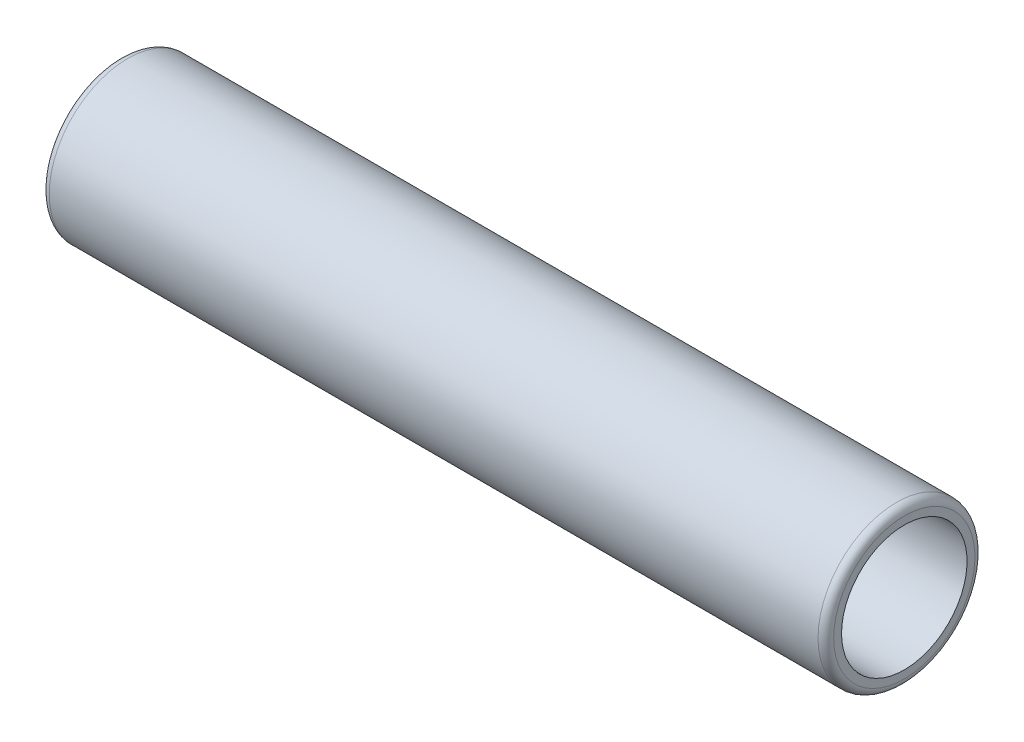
ISO-10303-21;
HEADER;
FILE_DESCRIPTION(('STEP AP214'),'2;1');
FILE_NAME('part.step','',(''),(''),'','','');
FILE_SCHEMA(('AUTOMOTIVE_DESIGN { 1 0 10303 214 1 1 1 1 }'));
ENDSEC;
DATA;
#1=APPLICATION_CONTEXT('core data for automotive mechanical design processes');
#2=APPLICATION_PROTOCOL_DEFINITION('international standard','automotive_design',2000,#1);
#3=PRODUCT_CONTEXT('',#1,'mechanical');
#4=PRODUCT('Part','Part','',(#3));
#5=PRODUCT_RELATED_PRODUCT_CATEGORY('part','',(#4));
#6=PRODUCT_DEFINITION_FORMATION('','',#4);
#7=PRODUCT_DEFINITION_CONTEXT('part definition',#1,'design');
#8=PRODUCT_DEFINITION('design','',#6,#7);
#9=PRODUCT_DEFINITION_SHAPE('','',#8);
#10=(LENGTH_UNIT() NAMED_UNIT(*) SI_UNIT(.MILLI.,.METRE.));
#11=(NAMED_UNIT(*) PLANE_ANGLE_UNIT() SI_UNIT($,.RADIAN.));
#12=(NAMED_UNIT(*) SI_UNIT($,.STERADIAN.) SOLID_ANGLE_UNIT());
#13=UNCERTAINTY_MEASURE_WITH_UNIT(LENGTH_MEASURE(1.E-05),#10,'distance_accuracy_value','');
#14=(GEOMETRIC_REPRESENTATION_CONTEXT(3) GLOBAL_UNCERTAINTY_ASSIGNED_CONTEXT((#13)) GLOBAL_UNIT_ASSIGNED_CONTEXT((#10,
#11,#12)) REPRESENTATION_CONTEXT('',''));
#15=CARTESIAN_POINT('',(0.,0.,0.));
#16=DIRECTION('',(0.,0.,1.));
#17=DIRECTION('',(1.,0.,0.));
#18=AXIS2_PLACEMENT_3D('',#15,#16,#17);
#19=CARTESIAN_POINT('',(0.,0.,0.));
#20=DIRECTION('',(-1.,0.,0.));
#21=DIRECTION('',(0.,0.,1.));
#22=AXIS2_PLACEMENT_3D('',#19,#20,#21);
#23=CYLINDRICAL_SURFACE('',#22,6.);
#24=CARTESIAN_POINT('',(11.,0.,0.));
#25=DIRECTION('',(-1.,0.,0.));
#26=DIRECTION('',(0.,0.,1.));
#27=AXIS2_PLACEMENT_3D('',#24,#25,#26);
#28=CIRCLE('',#27,6.);
#29=CARTESIAN_POINT('',(11.,0.,6.));
#30=VERTEX_POINT('',#29);
#31=EDGE_CURVE('E43',#30,#30,#28,.T.);
#32=ORIENTED_EDGE('',*,*,#31,.F.);
#33=EDGE_LOOP('',(#32));
#34=FACE_BOUND('',#33,.T.);
#35=CARTESIAN_POINT('',(0.,0.,0.));
#36=DIRECTION('',(-1.,0.,0.));
#37=DIRECTION('',(0.,0.,1.));
#38=AXIS2_PLACEMENT_3D('',#35,#36,#37);
#39=CIRCLE('',#38,6.);
#40=CARTESIAN_POINT('',(0.,0.,6.));
#41=VERTEX_POINT('',#40);
#42=EDGE_CURVE('E34',#41,#41,#39,.T.);
#43=ORIENTED_EDGE('',*,*,#42,.T.);
#44=EDGE_LOOP('',(#43));
#45=FACE_BOUND('',#44,.T.);
#46=ADVANCED_FACE('F14',(#34,#45),#23,.F.);
#47=CARTESIAN_POINT('',(0.,6.,0.));
#48=DIRECTION('',(1.,0.,0.));
#49=DIRECTION('',(0.,0.,-1.));
#50=AXIS2_PLACEMENT_3D('',#47,#48,#49);
#51=PLANE('',#50);
#52=CARTESIAN_POINT('',(0.,0.,0.));
#53=DIRECTION('',(1.,0.,0.));
#54=DIRECTION('',(0.,0.,-1.));
#55=AXIS2_PLACEMENT_3D('',#52,#53,#54);
#56=CIRCLE('',#55,9.);
#57=CARTESIAN_POINT('',(0.,0.,-9.));
#58=VERTEX_POINT('',#57);
#59=EDGE_CURVE('E21',#58,#58,#56,.F.);
#60=ORIENTED_EDGE('',*,*,#59,.T.);
#61=EDGE_LOOP('',(#60));
#62=FACE_BOUND('',#61,.T.);
#63=ORIENTED_EDGE('',*,*,#42,.F.);
#64=EDGE_LOOP('',(#63));
#65=FACE_BOUND('',#64,.T.);
#66=ADVANCED_FACE('F51',(#62,#65),#51,.F.);
#67=CARTESIAN_POINT('',(0.,0.,0.));
#68=DIRECTION('',(-1.,0.,0.));
#69=DIRECTION('',(0.,0.,1.));
#70=AXIS2_PLACEMENT_3D('',#67,#68,#69);
#71=CYLINDRICAL_SURFACE('',#70,10.);
#72=CARTESIAN_POINT('',(1.,0.,0.));
#73=DIRECTION('',(1.,0.,0.));
#74=DIRECTION('',(0.,0.,-1.));
#75=AXIS2_PLACEMENT_3D('',#72,#73,#74);
#76=CIRCLE('',#75,10.);
#77=CARTESIAN_POINT('',(1.,0.,-10.));
#78=VERTEX_POINT('',#77);
#79=EDGE_CURVE('E9',#78,#78,#76,.T.);
#80=ORIENTED_EDGE('',*,*,#79,.T.);
#81=EDGE_LOOP('',(#80));
#82=FACE_BOUND('',#81,.T.);
#83=CARTESIAN_POINT('',(99.,0.,0.));
#84=DIRECTION('',(-1.,0.,0.));
#85=DIRECTION('',(0.,0.,1.));
#86=AXIS2_PLACEMENT_3D('',#83,#84,#85);
#87=CIRCLE('',#86,10.);
#88=CARTESIAN_POINT('',(99.,0.,10.));
#89=VERTEX_POINT('',#88);
#90=EDGE_CURVE('E29',#89,#89,#87,.T.);
#91=ORIENTED_EDGE('',*,*,#90,.T.);
#92=EDGE_LOOP('',(#91));
#93=FACE_BOUND('',#92,.T.);
#94=ADVANCED_FACE('F56',(#82,#93),#71,.T.);
#95=CARTESIAN_POINT('',(100.,10.,0.));
#96=DIRECTION('',(-1.,0.,0.));
#97=DIRECTION('',(0.,0.,1.));
#98=AXIS2_PLACEMENT_3D('',#95,#96,#97);
#99=PLANE('',#98);
#100=CARTESIAN_POINT('',(100.,0.,0.));
#101=DIRECTION('',(-1.,0.,0.));
#102=DIRECTION('',(0.,0.,1.));
#103=AXIS2_PLACEMENT_3D('',#100,#101,#102);
#104=CIRCLE('',#103,9.);
#105=CARTESIAN_POINT('',(100.,0.,9.));
#106=VERTEX_POINT('',#105);
#107=EDGE_CURVE('E25',#106,#106,#104,.F.);
#108=ORIENTED_EDGE('',*,*,#107,.T.);
#109=EDGE_LOOP('',(#108));
#110=FACE_BOUND('',#109,.T.);
#111=CARTESIAN_POINT('',(100.,0.,0.));
#112=DIRECTION('',(-1.,0.,0.));
#113=DIRECTION('',(0.,0.,1.));
#114=AXIS2_PLACEMENT_3D('',#111,#112,#113);
#115=CIRCLE('',#114,8.);
#116=CARTESIAN_POINT('',(100.,0.,8.));
#117=VERTEX_POINT('',#116);
#118=EDGE_CURVE('E37',#117,#117,#115,.T.);
#119=ORIENTED_EDGE('',*,*,#118,.T.);
#120=EDGE_LOOP('',(#119));
#121=FACE_BOUND('',#120,.T.);
#122=ADVANCED_FACE('F63',(#110,#121),#99,.F.);
#123=CARTESIAN_POINT('',(0.,0.,0.));
#124=DIRECTION('',(-1.,0.,0.));
#125=DIRECTION('',(0.,0.,1.));
#126=AXIS2_PLACEMENT_3D('',#123,#124,#125);
#127=CYLINDRICAL_SURFACE('',#126,8.);
#128=ORIENTED_EDGE('',*,*,#118,.F.);
#129=EDGE_LOOP('',(#128));
#130=FACE_BOUND('',#129,.T.);
#131=CARTESIAN_POINT('',(13.,0.,0.));
#132=DIRECTION('',(-1.,0.,0.));
#133=DIRECTION('',(0.,0.,1.));
#134=AXIS2_PLACEMENT_3D('',#131,#132,#133);
#135=CIRCLE('',#134,8.);
#136=CARTESIAN_POINT('',(13.,0.,8.));
#137=VERTEX_POINT('',#136);
#138=EDGE_CURVE('E40',#137,#137,#135,.T.);
#139=ORIENTED_EDGE('',*,*,#138,.T.);
#140=EDGE_LOOP('',(#139));
#141=FACE_BOUND('',#140,.T.);
#142=ADVANCED_FACE('F75',(#130,#141),#127,.F.);
#143=CARTESIAN_POINT('',(11.,0.,0.));
#144=DIRECTION('',(1.,0.,0.));
#145=DIRECTION('',(0.,0.,-1.));
#146=AXIS2_PLACEMENT_3D('',#143,#144,#145);
#147=CONICAL_SURFACE('',#146,6.,0.785398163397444);
#148=ORIENTED_EDGE('',*,*,#138,.F.);
#149=EDGE_LOOP('',(#148));
#150=FACE_BOUND('',#149,.T.);
#151=ORIENTED_EDGE('',*,*,#31,.T.);
#152=EDGE_LOOP('',(#151));
#153=FACE_BOUND('',#152,.T.);
#154=ADVANCED_FACE('F47',(#150,#153),#147,.F.);
#155=CARTESIAN_POINT('',(99.,0.,0.));
#156=DIRECTION('',(-1.,0.,0.));
#157=DIRECTION('',(0.,0.,1.));
#158=AXIS2_PLACEMENT_3D('',#155,#156,#157);
#159=TOROIDAL_SURFACE('',#158,9.,1.);
#160=ORIENTED_EDGE('',*,*,#107,.F.);
#161=EDGE_LOOP('',(#160));
#162=FACE_BOUND('',#161,.T.);
#163=ORIENTED_EDGE('',*,*,#90,.F.);
#164=EDGE_LOOP('',(#163));
#165=FACE_BOUND('',#164,.T.);
#166=ADVANCED_FACE('F66',(#162,#165),#159,.T.);
#167=CARTESIAN_POINT('',(1.,0.,0.));
#168=DIRECTION('',(1.,0.,0.));
#169=DIRECTION('',(0.,0.,-1.));
#170=AXIS2_PLACEMENT_3D('',#167,#168,#169);
#171=TOROIDAL_SURFACE('',#170,9.,1.);
#172=ORIENTED_EDGE('',*,*,#79,.F.);
#173=EDGE_LOOP('',(#172));
#174=FACE_BOUND('',#173,.T.);
#175=ORIENTED_EDGE('',*,*,#59,.F.);
#176=EDGE_LOOP('',(#175));
#177=FACE_BOUND('',#176,.T.);
#178=ADVANCED_FACE('F16',(#174,#177),#171,.T.);
#179=CLOSED_SHELL('',(#46,#66,#94,#122,#142,#154,#166,#178));
#180=MANIFOLD_SOLID_BREP('B1',#179);
#181=ADVANCED_BREP_SHAPE_REPRESENTATION('',(#18,#180),#14);
#182=SHAPE_DEFINITION_REPRESENTATION(#9,#181);
ENDSEC;
END-ISO-10303-21;
